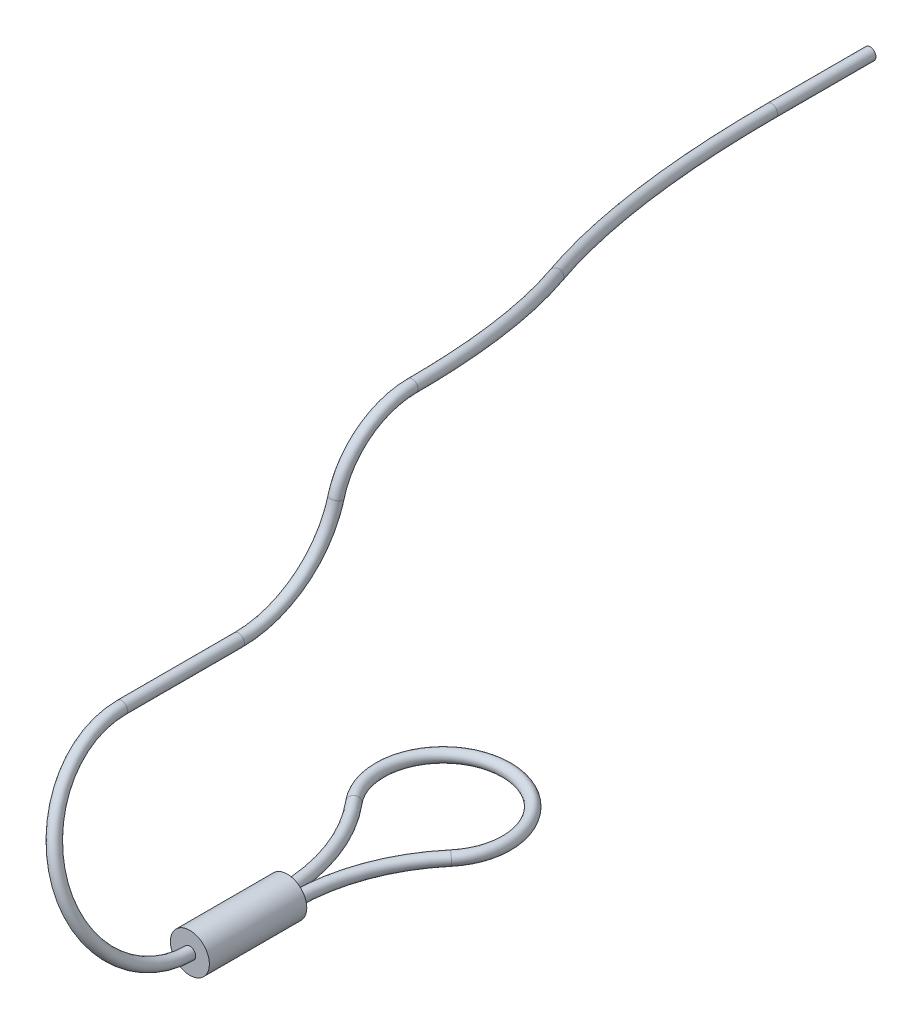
from build123d import *

# Parameters (mm, degrees)
SKETCH3_R      = 0.3
SKETCH4_R      = 1
EXTRUDE1_DEPTH = 5
SKETCH7_R      = 0.3
SKETCH8_R      = 0.3
SKETCH10_R     = 0.3


with BuildPart() as part:
    # Sweep1: sweep along a path in Sketch2
    with BuildLine(Plane(origin=(0, -13, 0), x_dir=(-1, 0, 0), z_dir=(0, 1, 0))) as sweep1_path:
        ThreePointArc((-10.325, 9), (-10.881554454, 5.85704491), (-12.483532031, 3.096322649))
        ThreePointArc((-12.483532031, 3.096322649), (-10, -2.25), (-7.516467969, 3.096322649))
        ThreePointArc((-7.516467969, 3.096322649), (-9.118445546, 5.85704491), (-9.675, 9))
    # Sketch3 → Sweep1 (sweep)
    with BuildSketch(Plane.XY.offset(9)):
        with Locations((10.325, -13)):
            Circle(SKETCH3_R)
    sweep(path=sweep1_path.line)

    # Sketch4 → Extrude1 (add)
    with BuildSketch(Plane.XY.offset(9)):
        with Locations((10, -13)):
            Circle(SKETCH4_R)
    extrude(amount=EXTRUDE1_DEPTH)

    # Sweep2: sweep along a path in Sketch6
    with BuildLine(Plane(origin=(4.393593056, 1.678158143, 0), x_dir=(0, 0, 1), z_dir=(-0.9341755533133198, -0.3568137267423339, 0))) as sweep2_path:
        ThreePointArc((14, -15.71241946), (18.904519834, -10.807899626), (14, -5.903379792))
    # Sketch7 → Sweep2 (sweep)
    with BuildSketch(Plane.XY.offset(14)):
        with Locations((10, -13)):
            Circle(SKETCH7_R)
    sweep(path=sweep2_path.line)

    # Sweep3: sweep along a path in Sketch5
    with BuildLine(Plane(origin=(6.5, 0, 0), x_dir=(0, 0, -1), z_dir=(1, 0, 0))) as sweep3_path:
        Line((-14, -3.83663494), (-8, -3.83663494))
        ThreePointArc((-8, -3.83663494), (-4.848818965, -2.766953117), (-3, 0))
        ThreePointArc((-3, 0), (-1.554343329, 2.163578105), (0.909676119, 3))
    # Sketch8 → Sweep3 (sweep)
    with BuildSketch(Plane(origin=(0, 0, 14), x_dir=(0.9965981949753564, -0.08241382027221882, 0), z_dir=(0, 0, -1))):
        with Locations((6.79408001, 3.287893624)):
            Circle(SKETCH8_R)
    sweep(path=sweep3_path.line)

    # Sweep4: sweep along a path in Sketch9
    with BuildLine(Plane(origin=(0, 0, 0), x_dir=(-0.9079593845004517, -0.419058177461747, 0), z_dir=(-0.41905817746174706, 0.9079593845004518, 0))) as sweep4_path:
        Line((-1, -30), (-1, -24.95045136))
        ThreePointArc((-1, -24.95045136), (-1.93851681, -17.505305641), (-4.695346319, -10.525986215))
        ThreePointArc((-4.695346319, -10.525986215), (-6.533232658, -5.873106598), (-7.158910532, -0.909676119))
    # Sketch10 → Sweep4 (sweep)
    with BuildSketch(Plane(origin=(0, 0, -0.909676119), x_dir=(-1, 0, 0), z_dir=(0, 0, -1))):
        with Locations((-6.5, 3)):
            Circle(SKETCH10_R)
    sweep(path=sweep4_path.line)


solid = part.part
